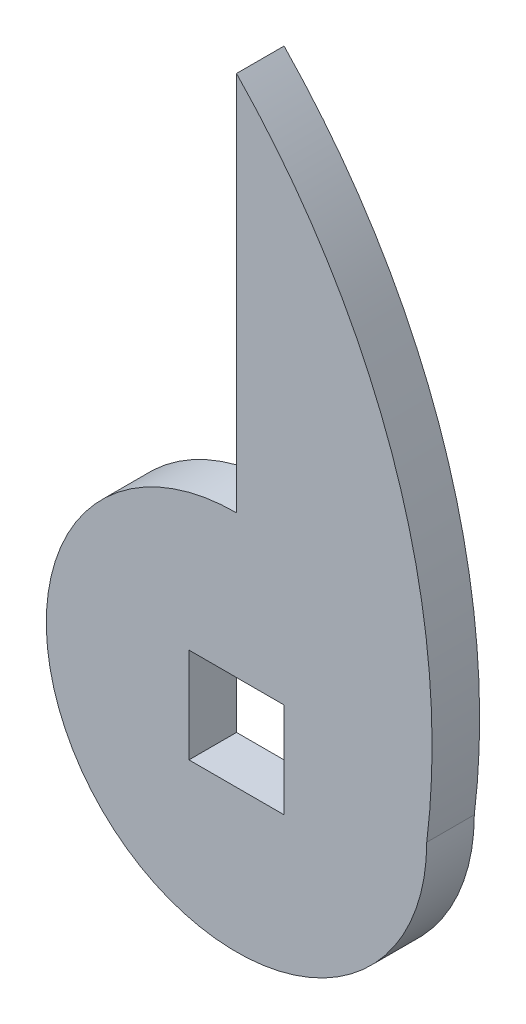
from build123d import *

# Parameters (mm, degrees)
SKETCH1_W           = 6.35
SKETCH1_H           = 6.35
BOSS_EXTRUDE1_DEPTH = 3.175


with BuildPart() as part:
    # Sketch1 → Boss-Extrude1 (new body)
    with BuildSketch(Plane.XY):
        with BuildLine():
            Line((-27.841097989, 19.848419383), (-27.841097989, 45.248419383))
            ThreePointArc((-27.841097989, 45.248419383), (-17.176377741, 27.636659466), (-15.141097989, 7.148419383))
            ThreePointArc((-15.141097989, 7.148419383), (-36.82135411, -1.831836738), (-27.841097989, 19.848419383))
        make_face()
        with Locations((-27.841097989, 7.148419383)):
            Rectangle(SKETCH1_W, SKETCH1_H, mode=Mode.SUBTRACT)
    extrude(amount=BOSS_EXTRUDE1_DEPTH)


solid = part.part
